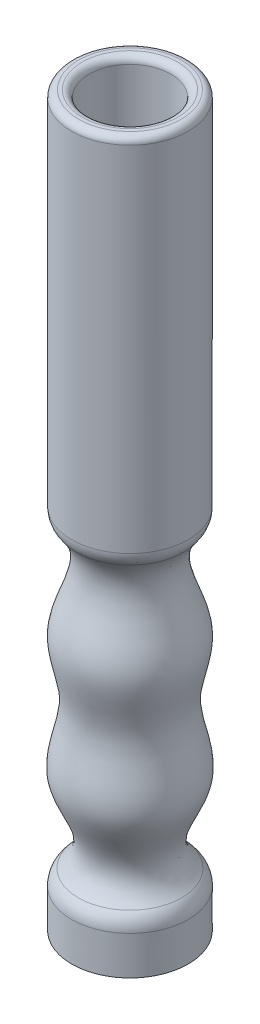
ISO-10303-21;
HEADER;
FILE_DESCRIPTION(('STEP AP214'),'2;1');
FILE_NAME('part.step','',(''),(''),'','','');
FILE_SCHEMA(('AUTOMOTIVE_DESIGN { 1 0 10303 214 1 1 1 1 }'));
ENDSEC;
DATA;
#1=APPLICATION_CONTEXT('core data for automotive mechanical design processes');
#2=APPLICATION_PROTOCOL_DEFINITION('international standard','automotive_design',2000,#1);
#3=PRODUCT_CONTEXT('',#1,'mechanical');
#4=PRODUCT('Part','Part','',(#3));
#5=PRODUCT_RELATED_PRODUCT_CATEGORY('part','',(#4));
#6=PRODUCT_DEFINITION_FORMATION('','',#4);
#7=PRODUCT_DEFINITION_CONTEXT('part definition',#1,'design');
#8=PRODUCT_DEFINITION('design','',#6,#7);
#9=PRODUCT_DEFINITION_SHAPE('','',#8);
#10=(LENGTH_UNIT() NAMED_UNIT(*) SI_UNIT(.MILLI.,.METRE.));
#11=(NAMED_UNIT(*) PLANE_ANGLE_UNIT() SI_UNIT($,.RADIAN.));
#12=(NAMED_UNIT(*) SI_UNIT($,.STERADIAN.) SOLID_ANGLE_UNIT());
#13=UNCERTAINTY_MEASURE_WITH_UNIT(LENGTH_MEASURE(1.E-05),#10,'distance_accuracy_value','');
#14=(GEOMETRIC_REPRESENTATION_CONTEXT(3) GLOBAL_UNCERTAINTY_ASSIGNED_CONTEXT((#13)) GLOBAL_UNIT_ASSIGNED_CONTEXT((#10,
#11,#12)) REPRESENTATION_CONTEXT('',''));
#15=CARTESIAN_POINT('',(0.,0.,0.));
#16=DIRECTION('',(0.,0.,1.));
#17=DIRECTION('',(1.,0.,0.));
#18=AXIS2_PLACEMENT_3D('',#15,#16,#17);
#19=CARTESIAN_POINT('',(0.,-39.3397406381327,0.));
#20=DIRECTION('',(0.,1.,0.));
#21=DIRECTION('',(0.,0.,1.));
#22=AXIS2_PLACEMENT_3D('',#19,#20,#21);
#23=CONICAL_SURFACE('',#22,8.39018916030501,0.00217348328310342);
#24=CARTESIAN_POINT('',(0.,-40.766619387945,0.));
#25=DIRECTION('',(0.,-1.,0.));
#26=DIRECTION('',(0.,0.,-1.));
#27=AXIS2_PLACEMENT_3D('',#24,#25,#26);
#28=CIRCLE('',#27,8.38708785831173);
#29=CARTESIAN_POINT('',(0.,-40.766619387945,-8.38708785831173));
#30=VERTEX_POINT('',#29);
#31=EDGE_CURVE('E59',#30,#30,#28,.T.);
#32=ORIENTED_EDGE('',*,*,#31,.T.);
#33=EDGE_LOOP('',(#32));
#34=FACE_BOUND('',#33,.T.);
#35=CARTESIAN_POINT('',(0.,-46.3281249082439,0.));
#36=DIRECTION('',(0.,1.,0.));
#37=DIRECTION('',(0.,0.,1.));
#38=AXIS2_PLACEMENT_3D('',#35,#36,#37);
#39=CIRCLE('',#38,8.375);
#40=CARTESIAN_POINT('',(0.,-46.3281249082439,8.375));
#41=VERTEX_POINT('',#40);
#42=EDGE_CURVE('E71',#41,#41,#39,.T.);
#43=ORIENTED_EDGE('',*,*,#42,.T.);
#44=EDGE_LOOP('',(#43));
#45=FACE_BOUND('',#44,.T.);
#46=ADVANCED_FACE('F39',(#34,#45),#23,.T.);
#47=CARTESIAN_POINT('',(0.,-46.3281249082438,0.));
#48=DIRECTION('',(0.,-1.,0.));
#49=DIRECTION('',(0.,0.,-1.));
#50=AXIS2_PLACEMENT_3D('',#47,#48,#49);
#51=PLANE('',#50);
#52=ORIENTED_EDGE('',*,*,#42,.F.);
#53=EDGE_LOOP('',(#52));
#54=FACE_BOUND('',#53,.T.);
#55=ADVANCED_FACE('F102',(#54),#51,.T.);
#56=CARTESIAN_POINT('',(-5.87499999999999,23.828125,0.));
#57=DIRECTION('',(0.,1.,0.));
#58=DIRECTION('',(0.,0.,1.));
#59=AXIS2_PLACEMENT_3D('',#56,#57,#58);
#60=PLANE('',#59);
#61=CARTESIAN_POINT('',(0.,23.828125,0.));
#62=DIRECTION('',(0.,1.,0.));
#63=DIRECTION('',(0.,0.,1.));
#64=AXIS2_PLACEMENT_3D('',#61,#62,#63);
#65=CIRCLE('',#64,5.87499999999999);
#66=CARTESIAN_POINT('',(0.,23.828125,5.87499999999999));
#67=VERTEX_POINT('',#66);
#68=EDGE_CURVE('E74',#67,#67,#65,.T.);
#69=ORIENTED_EDGE('',*,*,#68,.T.);
#70=EDGE_LOOP('',(#69));
#71=FACE_BOUND('',#70,.T.);
#72=ADVANCED_FACE('F98',(#71),#60,.T.);
#73=CARTESIAN_POINT('',(0.,80.2343749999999,0.));
#74=DIRECTION('',(0.,1.,0.));
#75=DIRECTION('',(0.,0.,1.));
#76=AXIS2_PLACEMENT_3D('',#73,#74,#75);
#77=CYLINDRICAL_SURFACE('',#76,5.87499999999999);
#78=CARTESIAN_POINT('',(0.,57.3593749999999,0.));
#79=DIRECTION('',(0.,1.,0.));
#80=DIRECTION('',(0.,0.,1.));
#81=AXIS2_PLACEMENT_3D('',#78,#79,#80);
#82=CIRCLE('',#81,5.87499999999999);
#83=CARTESIAN_POINT('',(0.,57.3593749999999,5.87499999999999));
#84=VERTEX_POINT('',#83);
#85=EDGE_CURVE('E54',#84,#84,#82,.T.);
#86=ORIENTED_EDGE('',*,*,#85,.T.);
#87=EDGE_LOOP('',(#86));
#88=FACE_BOUND('',#87,.T.);
#89=ORIENTED_EDGE('',*,*,#68,.F.);
#90=EDGE_LOOP('',(#89));
#91=FACE_BOUND('',#90,.T.);
#92=ADVANCED_FACE('F95',(#88,#91),#77,.F.);
#93=CARTESIAN_POINT('',(-8.375,58.3593749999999,0.));
#94=DIRECTION('',(0.,1.,0.));
#95=DIRECTION('',(0.,0.,1.));
#96=AXIS2_PLACEMENT_3D('',#93,#94,#95);
#97=PLANE('',#96);
#98=CARTESIAN_POINT('',(0.,58.3593749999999,0.));
#99=DIRECTION('',(0.,1.,0.));
#100=DIRECTION('',(0.,0.,1.));
#101=AXIS2_PLACEMENT_3D('',#98,#99,#100);
#102=CIRCLE('',#101,6.87499999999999);
#103=CARTESIAN_POINT('',(0.,58.3593749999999,6.87499999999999));
#104=VERTEX_POINT('',#103);
#105=EDGE_CURVE('E46',#104,#104,#102,.F.);
#106=ORIENTED_EDGE('',*,*,#105,.T.);
#107=EDGE_LOOP('',(#106));
#108=FACE_BOUND('',#107,.T.);
#109=CARTESIAN_POINT('',(0.,58.3593749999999,0.));
#110=DIRECTION('',(0.,1.,0.));
#111=DIRECTION('',(0.,0.,1.));
#112=AXIS2_PLACEMENT_3D('',#109,#110,#111);
#113=CIRCLE('',#112,7.375);
#114=CARTESIAN_POINT('',(0.,58.3593749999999,7.375));
#115=VERTEX_POINT('',#114);
#116=EDGE_CURVE('E50',#115,#115,#113,.T.);
#117=ORIENTED_EDGE('',*,*,#116,.T.);
#118=EDGE_LOOP('',(#117));
#119=FACE_BOUND('',#118,.T.);
#120=ADVANCED_FACE('F92',(#108,#119),#97,.T.);
#121=CARTESIAN_POINT('',(0.,80.2343749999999,0.));
#122=DIRECTION('',(0.,1.,0.));
#123=DIRECTION('',(0.,0.,1.));
#124=AXIS2_PLACEMENT_3D('',#121,#122,#123);
#125=CYLINDRICAL_SURFACE('',#124,8.375);
#126=CARTESIAN_POINT('',(0.,57.3593749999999,0.));
#127=DIRECTION('',(0.,1.,0.));
#128=DIRECTION('',(0.,0.,1.));
#129=AXIS2_PLACEMENT_3D('',#126,#127,#128);
#130=CIRCLE('',#129,8.375);
#131=CARTESIAN_POINT('',(0.,57.3593749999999,8.375));
#132=VERTEX_POINT('',#131);
#133=EDGE_CURVE('E10',#132,#132,#130,.F.);
#134=ORIENTED_EDGE('',*,*,#133,.T.);
#135=EDGE_LOOP('',(#134));
#136=FACE_BOUND('',#135,.T.);
#137=CARTESIAN_POINT('',(0.,6.51437640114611,0.));
#138=DIRECTION('',(0.,-1.,0.));
#139=DIRECTION('',(0.,0.,-1.));
#140=AXIS2_PLACEMENT_3D('',#137,#138,#139);
#141=CIRCLE('',#140,8.375);
#142=CARTESIAN_POINT('',(0.,6.51437640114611,-8.375));
#143=VERTEX_POINT('',#142);
#144=EDGE_CURVE('E68',#143,#143,#141,.F.);
#145=ORIENTED_EDGE('',*,*,#144,.T.);
#146=EDGE_LOOP('',(#145));
#147=FACE_BOUND('',#146,.T.);
#148=ADVANCED_FACE('F88',(#136,#147),#125,.T.);
#149=CARTESIAN_POINT('',(-8.375,5.34775916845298,0.));
#150=CARTESIAN_POINT('',(-3.18432106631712,0.223454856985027,0.));
#151=CARTESIAN_POINT('',(-10.9763687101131,-7.05873572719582,0.));
#152=CARTESIAN_POINT('',(-5.58182127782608,-17.9048057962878,0.));
#153=CARTESIAN_POINT('',(-11.3057407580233,-28.452781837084,0.));
#154=CARTESIAN_POINT('',(-2.65496888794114,-35.2265081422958,0.));
#155=CARTESIAN_POINT('',(-8.39018916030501,-39.3397406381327,0.));
#156=B_SPLINE_CURVE_WITH_KNOTS('',3,(#149,#150,#151,#152,#153,#154,#155),.UNSPECIFIED.,.F.,.F.,
(4,1,1,1,4),(0.,0.320570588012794,0.505670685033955,0.710917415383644,1.),.UNSPECIFIED.);
#157=CARTESIAN_POINT('',(0.,80.2343749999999,0.));
#158=DIRECTION('',(0.,1.,0.));
#159=AXIS1_PLACEMENT('',#157,#158);
#160=SURFACE_OF_REVOLUTION('',#156,#159);
#161=CARTESIAN_POINT('',(0.,4.59417500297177,0.));
#162=DIRECTION('',(0.,1.,0.));
#163=DIRECTION('',(0.,0.,1.));
#164=AXIS2_PLACEMENT_3D('',#161,#162,#163);
#165=CIRCLE('',#164,7.67995696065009);
#166=CARTESIAN_POINT('',(0.,4.59417500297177,7.67995696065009));
#167=VERTEX_POINT('',#166);
#168=EDGE_CURVE('E62',#167,#167,#165,.F.);
#169=ORIENTED_EDGE('',*,*,#168,.T.);
#170=EDGE_LOOP('',(#169));
#171=FACE_BOUND('',#170,.T.);
#172=CARTESIAN_POINT('',(0.,-38.5582152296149,0.));
#173=DIRECTION('',(0.,1.,0.));
#174=DIRECTION('',(0.,0.,1.));
#175=AXIS2_PLACEMENT_3D('',#172,#173,#174);
#176=CIRCLE('',#175,7.42466901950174);
#177=CARTESIAN_POINT('',(0.,-38.5582152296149,7.42466901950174));
#178=VERTEX_POINT('',#177);
#179=EDGE_CURVE('E65',#178,#178,#176,.T.);
#180=ORIENTED_EDGE('',*,*,#179,.T.);
#181=EDGE_LOOP('',(#180));
#182=FACE_BOUND('',#181,.T.);
#183=ADVANCED_FACE('F84',(#171,#182),#160,.F.);
#184=CARTESIAN_POINT('',(0.,6.51437640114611,0.));
#185=DIRECTION('',(0.,-1.,0.));
#186=DIRECTION('',(0.,0.,-1.));
#187=AXIS2_PLACEMENT_3D('',#184,#185,#186);
#188=TOROIDAL_SURFACE('',#187,5.375,3.);
#189=ORIENTED_EDGE('',*,*,#168,.F.);
#190=EDGE_LOOP('',(#189));
#191=FACE_BOUND('',#190,.T.);
#192=ORIENTED_EDGE('',*,*,#144,.F.);
#193=EDGE_LOOP('',(#192));
#194=FACE_BOUND('',#193,.T.);
#195=ADVANCED_FACE('F87',(#191,#194),#188,.T.);
#196=CARTESIAN_POINT('',(0.,-40.7600989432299,0.));
#197=DIRECTION('',(0.,-1.,0.));
#198=DIRECTION('',(0.,0.,-1.));
#199=AXIS2_PLACEMENT_3D('',#196,#197,#198);
#200=TOROIDAL_SURFACE('',#199,5.38709494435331,3.);
#201=ORIENTED_EDGE('',*,*,#31,.F.);
#202=EDGE_LOOP('',(#201));
#203=FACE_BOUND('',#202,.T.);
#204=ORIENTED_EDGE('',*,*,#179,.F.);
#205=EDGE_LOOP('',(#204));
#206=FACE_BOUND('',#205,.T.);
#207=ADVANCED_FACE('F112',(#203,#206),#200,.T.);
#208=CARTESIAN_POINT('',(0.,57.3593749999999,0.));
#209=DIRECTION('',(0.,1.,0.));
#210=DIRECTION('',(0.,0.,1.));
#211=AXIS2_PLACEMENT_3D('',#208,#209,#210);
#212=TOROIDAL_SURFACE('',#211,6.87499999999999,1.);
#213=ORIENTED_EDGE('',*,*,#105,.F.);
#214=EDGE_LOOP('',(#213));
#215=FACE_BOUND('',#214,.T.);
#216=ORIENTED_EDGE('',*,*,#85,.F.);
#217=EDGE_LOOP('',(#216));
#218=FACE_BOUND('',#217,.T.);
#219=ADVANCED_FACE('F115',(#215,#218),#212,.T.);
#220=CARTESIAN_POINT('',(0.,57.3593749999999,0.));
#221=DIRECTION('',(0.,1.,0.));
#222=DIRECTION('',(0.,0.,1.));
#223=AXIS2_PLACEMENT_3D('',#220,#221,#222);
#224=TOROIDAL_SURFACE('',#223,7.375,1.);
#225=ORIENTED_EDGE('',*,*,#133,.F.);
#226=EDGE_LOOP('',(#225));
#227=FACE_BOUND('',#226,.T.);
#228=ORIENTED_EDGE('',*,*,#116,.F.);
#229=EDGE_LOOP('',(#228));
#230=FACE_BOUND('',#229,.T.);
#231=ADVANCED_FACE('F41',(#227,#230),#224,.T.);
#232=CLOSED_SHELL('',(#46,#55,#72,#92,#120,#148,#183,#195,#207,#219,#231));
#233=MANIFOLD_SOLID_BREP('B2',#232);
#234=ADVANCED_BREP_SHAPE_REPRESENTATION('',(#18,#233),#14);
#235=SHAPE_DEFINITION_REPRESENTATION(#9,#234);
ENDSEC;
END-ISO-10303-21;
